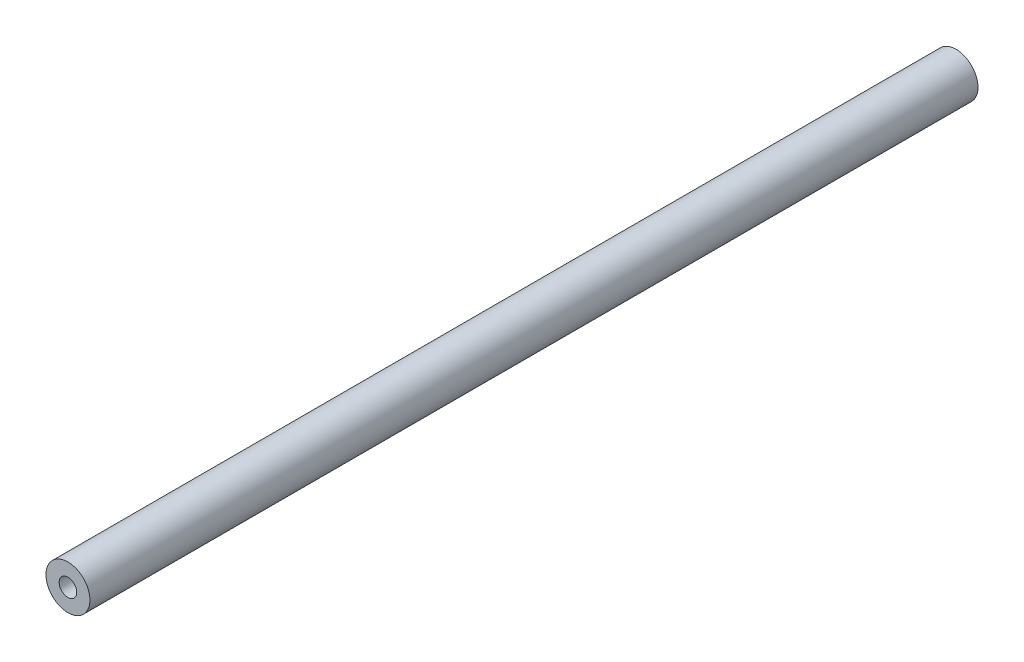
ISO-10303-21;
HEADER;
FILE_DESCRIPTION(('STEP AP214'),'2;1');
FILE_NAME('part.step','',(''),(''),'','','');
FILE_SCHEMA(('AUTOMOTIVE_DESIGN { 1 0 10303 214 1 1 1 1 }'));
ENDSEC;
DATA;
#1=APPLICATION_CONTEXT('core data for automotive mechanical design processes');
#2=APPLICATION_PROTOCOL_DEFINITION('international standard','automotive_design',2000,#1);
#3=PRODUCT_CONTEXT('',#1,'mechanical');
#4=PRODUCT('Part','Part','',(#3));
#5=PRODUCT_RELATED_PRODUCT_CATEGORY('part','',(#4));
#6=PRODUCT_DEFINITION_FORMATION('','',#4);
#7=PRODUCT_DEFINITION_CONTEXT('part definition',#1,'design');
#8=PRODUCT_DEFINITION('design','',#6,#7);
#9=PRODUCT_DEFINITION_SHAPE('','',#8);
#10=(LENGTH_UNIT() NAMED_UNIT(*) SI_UNIT(.MILLI.,.METRE.));
#11=(NAMED_UNIT(*) PLANE_ANGLE_UNIT() SI_UNIT($,.RADIAN.));
#12=(NAMED_UNIT(*) SI_UNIT($,.STERADIAN.) SOLID_ANGLE_UNIT());
#13=UNCERTAINTY_MEASURE_WITH_UNIT(LENGTH_MEASURE(1.E-05),#10,'distance_accuracy_value','');
#14=(GEOMETRIC_REPRESENTATION_CONTEXT(3) GLOBAL_UNCERTAINTY_ASSIGNED_CONTEXT((#13)) GLOBAL_UNIT_ASSIGNED_CONTEXT((#10,
#11,#12)) REPRESENTATION_CONTEXT('',''));
#15=CARTESIAN_POINT('',(0.,0.,0.));
#16=DIRECTION('',(0.,0.,1.));
#17=DIRECTION('',(1.,0.,0.));
#18=AXIS2_PLACEMENT_3D('',#15,#16,#17);
#19=CARTESIAN_POINT('',(0.,0.,202.));
#20=DIRECTION('',(0.,0.,-1.));
#21=DIRECTION('',(-1.,0.,0.));
#22=AXIS2_PLACEMENT_3D('',#19,#20,#21);
#23=CYLINDRICAL_SURFACE('',#22,5.);
#24=CARTESIAN_POINT('',(0.,0.,202.));
#25=DIRECTION('',(0.,0.,1.));
#26=DIRECTION('',(1.,0.,0.));
#27=AXIS2_PLACEMENT_3D('',#24,#25,#26);
#28=CIRCLE('',#27,5.);
#29=CARTESIAN_POINT('',(5.,0.,202.));
#30=VERTEX_POINT('',#29);
#31=EDGE_CURVE('E10',#30,#30,#28,.T.);
#32=ORIENTED_EDGE('',*,*,#31,.F.);
#33=EDGE_LOOP('',(#32));
#34=FACE_BOUND('',#33,.T.);
#35=CARTESIAN_POINT('',(0.,0.,0.));
#36=DIRECTION('',(0.,0.,1.));
#37=DIRECTION('',(1.,0.,0.));
#38=AXIS2_PLACEMENT_3D('',#35,#36,#37);
#39=CIRCLE('',#38,5.);
#40=CARTESIAN_POINT('',(5.,0.,0.));
#41=VERTEX_POINT('',#40);
#42=EDGE_CURVE('E34',#41,#41,#39,.T.);
#43=ORIENTED_EDGE('',*,*,#42,.T.);
#44=EDGE_LOOP('',(#43));
#45=FACE_BOUND('',#44,.T.);
#46=ADVANCED_FACE('F31',(#34,#45),#23,.T.);
#47=CARTESIAN_POINT('',(0.,0.,202.));
#48=DIRECTION('',(0.,0.,1.));
#49=DIRECTION('',(1.,0.,0.));
#50=AXIS2_PLACEMENT_3D('',#47,#48,#49);
#51=PLANE('',#50);
#52=CARTESIAN_POINT('',(0.,0.,202.));
#53=DIRECTION('',(0.,0.,1.));
#54=DIRECTION('',(1.,0.,0.));
#55=AXIS2_PLACEMENT_3D('',#52,#53,#54);
#56=CIRCLE('',#55,2.);
#57=CARTESIAN_POINT('',(2.,0.,202.));
#58=VERTEX_POINT('',#57);
#59=EDGE_CURVE('E43',#58,#58,#56,.T.);
#60=ORIENTED_EDGE('',*,*,#59,.F.);
#61=EDGE_LOOP('',(#60));
#62=FACE_BOUND('',#61,.T.);
#63=ORIENTED_EDGE('',*,*,#31,.T.);
#64=EDGE_LOOP('',(#63));
#65=FACE_BOUND('',#64,.T.);
#66=ADVANCED_FACE('F68',(#62,#65),#51,.T.);
#67=CARTESIAN_POINT('',(0.,0.,0.));
#68=DIRECTION('',(0.,0.,1.));
#69=DIRECTION('',(1.,0.,0.));
#70=AXIS2_PLACEMENT_3D('',#67,#68,#69);
#71=PLANE('',#70);
#72=CARTESIAN_POINT('',(0.,0.,0.));
#73=DIRECTION('',(0.,0.,-1.));
#74=DIRECTION('',(-1.,0.,0.));
#75=AXIS2_PLACEMENT_3D('',#72,#73,#74);
#76=CIRCLE('',#75,2.);
#77=CARTESIAN_POINT('',(-2.,0.,0.));
#78=VERTEX_POINT('',#77);
#79=EDGE_CURVE('E49',#78,#78,#76,.T.);
#80=ORIENTED_EDGE('',*,*,#79,.F.);
#81=EDGE_LOOP('',(#80));
#82=FACE_BOUND('',#81,.T.);
#83=ORIENTED_EDGE('',*,*,#42,.F.);
#84=EDGE_LOOP('',(#83));
#85=FACE_BOUND('',#84,.T.);
#86=ADVANCED_FACE('F64',(#82,#85),#71,.F.);
#87=CARTESIAN_POINT('',(0.,0.,177.));
#88=DIRECTION('',(0.,0.,1.));
#89=DIRECTION('',(1.,0.,0.));
#90=AXIS2_PLACEMENT_3D('',#87,#88,#89);
#91=CYLINDRICAL_SURFACE('',#90,2.);
#92=CARTESIAN_POINT('',(0.,0.,177.));
#93=DIRECTION('',(0.,0.,1.));
#94=DIRECTION('',(1.,0.,0.));
#95=AXIS2_PLACEMENT_3D('',#92,#93,#94);
#96=CIRCLE('',#95,2.);
#97=CARTESIAN_POINT('',(2.,0.,177.));
#98=VERTEX_POINT('',#97);
#99=EDGE_CURVE('E41',#98,#98,#96,.T.);
#100=ORIENTED_EDGE('',*,*,#99,.F.);
#101=EDGE_LOOP('',(#100));
#102=FACE_BOUND('',#101,.T.);
#103=ORIENTED_EDGE('',*,*,#59,.T.);
#104=EDGE_LOOP('',(#103));
#105=FACE_BOUND('',#104,.T.);
#106=ADVANCED_FACE('F67',(#102,#105),#91,.F.);
#107=CARTESIAN_POINT('',(0.,0.,177.));
#108=DIRECTION('',(0.,0.,1.));
#109=DIRECTION('',(1.,0.,0.));
#110=AXIS2_PLACEMENT_3D('',#107,#108,#109);
#111=PLANE('',#110);
#112=ORIENTED_EDGE('',*,*,#99,.T.);
#113=EDGE_LOOP('',(#112));
#114=FACE_BOUND('',#113,.T.);
#115=ADVANCED_FACE('F60',(#114),#111,.T.);
#116=CARTESIAN_POINT('',(0.,0.,25.));
#117=DIRECTION('',(0.,0.,-1.));
#118=DIRECTION('',(-1.,0.,0.));
#119=AXIS2_PLACEMENT_3D('',#116,#117,#118);
#120=CYLINDRICAL_SURFACE('',#119,2.);
#121=CARTESIAN_POINT('',(0.,0.,25.));
#122=DIRECTION('',(0.,0.,-1.));
#123=DIRECTION('',(-1.,0.,0.));
#124=AXIS2_PLACEMENT_3D('',#121,#122,#123);
#125=CIRCLE('',#124,2.);
#126=CARTESIAN_POINT('',(-2.,0.,25.));
#127=VERTEX_POINT('',#126);
#128=EDGE_CURVE('E46',#127,#127,#125,.T.);
#129=ORIENTED_EDGE('',*,*,#128,.F.);
#130=EDGE_LOOP('',(#129));
#131=FACE_BOUND('',#130,.T.);
#132=ORIENTED_EDGE('',*,*,#79,.T.);
#133=EDGE_LOOP('',(#132));
#134=FACE_BOUND('',#133,.T.);
#135=ADVANCED_FACE('F57',(#131,#134),#120,.F.);
#136=CARTESIAN_POINT('',(0.,0.,25.));
#137=DIRECTION('',(0.,0.,-1.));
#138=DIRECTION('',(-1.,0.,0.));
#139=AXIS2_PLACEMENT_3D('',#136,#137,#138);
#140=PLANE('',#139);
#141=ORIENTED_EDGE('',*,*,#128,.T.);
#142=EDGE_LOOP('',(#141));
#143=FACE_BOUND('',#142,.T.);
#144=ADVANCED_FACE('F55',(#143),#140,.T.);
#145=CLOSED_SHELL('',(#46,#66,#86,#106,#115,#135,#144));
#146=MANIFOLD_SOLID_BREP('B2',#145);
#147=ADVANCED_BREP_SHAPE_REPRESENTATION('',(#18,#146),#14);
#148=SHAPE_DEFINITION_REPRESENTATION(#9,#147);
ENDSEC;
END-ISO-10303-21;
